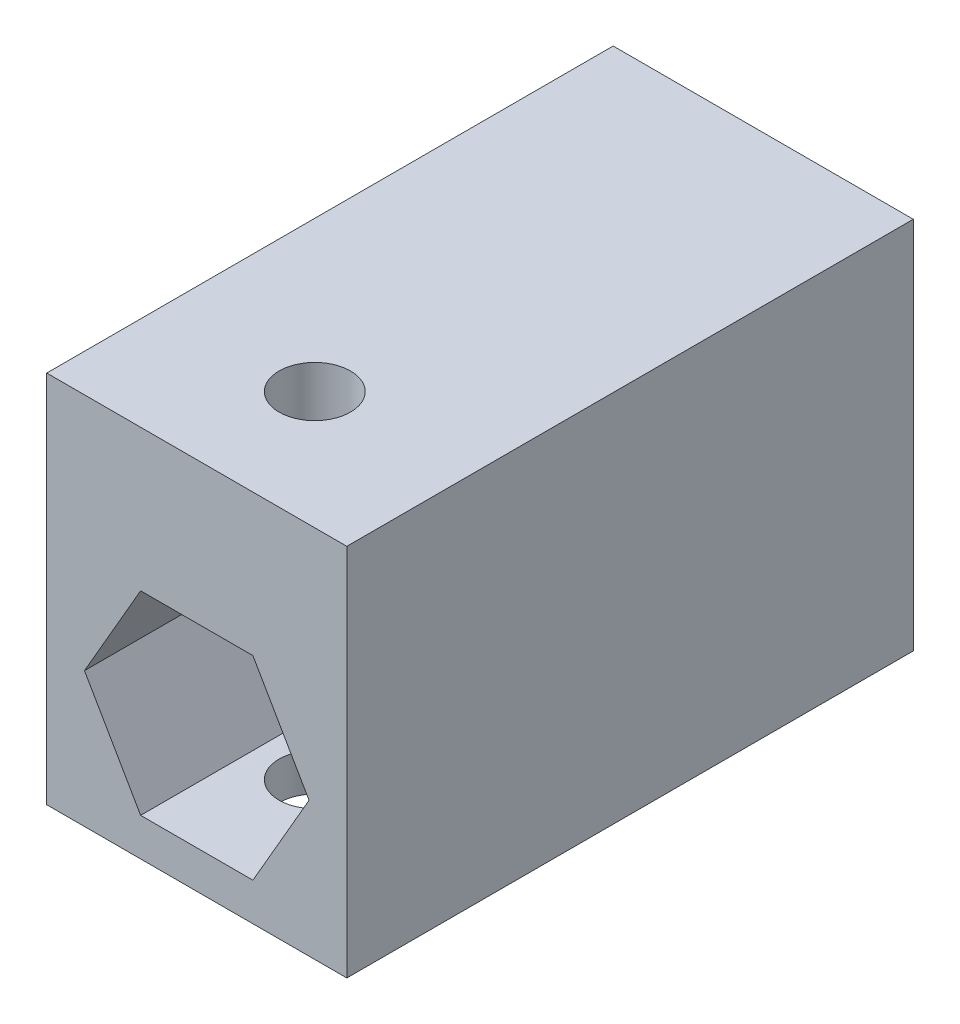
ISO-10303-21;
HEADER;
FILE_DESCRIPTION(('STEP AP214'),'2;1');
FILE_NAME('part.step','',(''),(''),'','','');
FILE_SCHEMA(('AUTOMOTIVE_DESIGN { 1 0 10303 214 1 1 1 1 }'));
ENDSEC;
DATA;
#1=APPLICATION_CONTEXT('core data for automotive mechanical design processes');
#2=APPLICATION_PROTOCOL_DEFINITION('international standard','automotive_design',2000,#1);
#3=PRODUCT_CONTEXT('',#1,'mechanical');
#4=PRODUCT('Part','Part','',(#3));
#5=PRODUCT_RELATED_PRODUCT_CATEGORY('part','',(#4));
#6=PRODUCT_DEFINITION_FORMATION('','',#4);
#7=PRODUCT_DEFINITION_CONTEXT('part definition',#1,'design');
#8=PRODUCT_DEFINITION('design','',#6,#7);
#9=PRODUCT_DEFINITION_SHAPE('','',#8);
#10=(LENGTH_UNIT() NAMED_UNIT(*) SI_UNIT(.MILLI.,.METRE.));
#11=(NAMED_UNIT(*) PLANE_ANGLE_UNIT() SI_UNIT($,.RADIAN.));
#12=(NAMED_UNIT(*) SI_UNIT($,.STERADIAN.) SOLID_ANGLE_UNIT());
#13=UNCERTAINTY_MEASURE_WITH_UNIT(LENGTH_MEASURE(1.E-05),#10,'distance_accuracy_value','');
#14=(GEOMETRIC_REPRESENTATION_CONTEXT(3) GLOBAL_UNCERTAINTY_ASSIGNED_CONTEXT((#13)) GLOBAL_UNIT_ASSIGNED_CONTEXT((#10,
#11,#12)) REPRESENTATION_CONTEXT('',''));
#15=CARTESIAN_POINT('',(0.,0.,0.));
#16=DIRECTION('',(0.,0.,1.));
#17=DIRECTION('',(1.,0.,0.));
#18=AXIS2_PLACEMENT_3D('',#15,#16,#17);
#19=CARTESIAN_POINT('',(0.,0.,28.575));
#20=DIRECTION('',(0.,0.,-1.));
#21=DIRECTION('',(-1.,0.,0.));
#22=AXIS2_PLACEMENT_3D('',#19,#20,#21);
#23=PLANE('',#22);
#24=DIRECTION('',(0.,-1.,0.));
#25=VECTOR('',#24,1.);
#26=CARTESIAN_POINT('',(0.,0.,28.575));
#27=LINE('',#26,#25);
#28=CARTESIAN_POINT('',(0.,25.146,28.575));
#29=VERTEX_POINT('',#28);
#30=CARTESIAN_POINT('',(0.,0.,28.575));
#31=VERTEX_POINT('',#30);
#32=EDGE_CURVE('E195',#29,#31,#27,.T.);
#33=ORIENTED_EDGE('',*,*,#32,.T.);
#34=DIRECTION('',(1.,0.,0.));
#35=VECTOR('',#34,1.);
#36=CARTESIAN_POINT('',(0.,0.,28.575));
#37=LINE('',#36,#35);
#38=CARTESIAN_POINT('',(20.184637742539,0.,28.575));
#39=VERTEX_POINT('',#38);
#40=EDGE_CURVE('E198',#31,#39,#37,.T.);
#41=ORIENTED_EDGE('',*,*,#40,.T.);
#42=DIRECTION('',(0.,1.,0.));
#43=VECTOR('',#42,1.);
#44=CARTESIAN_POINT('',(20.184637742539,0.,28.575));
#45=LINE('',#44,#43);
#46=CARTESIAN_POINT('',(20.184637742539,25.146,28.575));
#47=VERTEX_POINT('',#46);
#48=EDGE_CURVE('E120',#39,#47,#45,.T.);
#49=ORIENTED_EDGE('',*,*,#48,.T.);
#50=DIRECTION('',(-1.,0.,0.));
#51=VECTOR('',#50,1.);
#52=CARTESIAN_POINT('',(0.,25.146,28.575));
#53=LINE('',#52,#51);
#54=EDGE_CURVE('E201',#47,#29,#53,.T.);
#55=ORIENTED_EDGE('',*,*,#54,.T.);
#56=EDGE_LOOP('',(#33,#41,#49,#55));
#57=FACE_BOUND('',#56,.T.);
#58=DIRECTION('',(-0.5,0.866025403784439,0.));
#59=VECTOR('',#58,1.);
#60=CARTESIAN_POINT('',(17.644637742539,9.0805,28.575));
#61=LINE('',#60,#59);
#62=CARTESIAN_POINT('',(17.644637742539,9.0805,28.575));
#63=VERTEX_POINT('',#62);
#64=CARTESIAN_POINT('',(13.8684783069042,15.621,28.575));
#65=VERTEX_POINT('',#64);
#66=EDGE_CURVE('E156',#63,#65,#61,.T.);
#67=ORIENTED_EDGE('',*,*,#66,.F.);
#68=DIRECTION('',(0.5,0.866025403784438,0.));
#69=VECTOR('',#68,1.);
#70=CARTESIAN_POINT('',(13.8684783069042,2.54,28.575));
#71=LINE('',#70,#69);
#72=CARTESIAN_POINT('',(13.8684783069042,2.54,28.575));
#73=VERTEX_POINT('',#72);
#74=EDGE_CURVE('E167',#73,#63,#71,.T.);
#75=ORIENTED_EDGE('',*,*,#74,.F.);
#76=DIRECTION('',(1.,0.,0.));
#77=VECTOR('',#76,1.);
#78=CARTESIAN_POINT('',(6.31615943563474,2.54,28.575));
#79=LINE('',#78,#77);
#80=CARTESIAN_POINT('',(6.31615943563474,2.54,28.575));
#81=VERTEX_POINT('',#80);
#82=EDGE_CURVE('E165',#81,#73,#79,.T.);
#83=ORIENTED_EDGE('',*,*,#82,.F.);
#84=DIRECTION('',(0.5,-0.866025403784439,0.));
#85=VECTOR('',#84,1.);
#86=CARTESIAN_POINT('',(2.54,9.08049999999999,28.575));
#87=LINE('',#86,#85);
#88=CARTESIAN_POINT('',(2.54,9.08049999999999,28.575));
#89=VERTEX_POINT('',#88);
#90=EDGE_CURVE('E163',#89,#81,#87,.T.);
#91=ORIENTED_EDGE('',*,*,#90,.F.);
#92=DIRECTION('',(-0.5,-0.866025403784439,0.));
#93=VECTOR('',#92,1.);
#94=CARTESIAN_POINT('',(6.31615943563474,15.621,28.575));
#95=LINE('',#94,#93);
#96=CARTESIAN_POINT('',(6.31615943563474,15.621,28.575));
#97=VERTEX_POINT('',#96);
#98=EDGE_CURVE('E161',#97,#89,#95,.T.);
#99=ORIENTED_EDGE('',*,*,#98,.F.);
#100=DIRECTION('',(-1.,0.,0.));
#101=VECTOR('',#100,1.);
#102=CARTESIAN_POINT('',(13.8684783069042,15.621,28.575));
#103=LINE('',#102,#101);
#104=EDGE_CURVE('E158',#65,#97,#103,.T.);
#105=ORIENTED_EDGE('',*,*,#104,.F.);
#106=EDGE_LOOP('',(#67,#75,#83,#91,#99,#105));
#107=FACE_BOUND('',#106,.T.);
#108=ADVANCED_FACE('F35',(#57,#107),#23,.F.);
#109=CARTESIAN_POINT('',(0.,0.,28.575));
#110=DIRECTION('',(1.,0.,0.));
#111=DIRECTION('',(0.,0.,-1.));
#112=AXIS2_PLACEMENT_3D('',#109,#110,#111);
#113=PLANE('',#112);
#114=DIRECTION('',(0.,0.,-1.));
#115=VECTOR('',#114,1.);
#116=CARTESIAN_POINT('',(0.,25.146,28.575));
#117=LINE('',#116,#115);
#118=CARTESIAN_POINT('',(0.,25.146,-9.525));
#119=VERTEX_POINT('',#118);
#120=EDGE_CURVE('E203',#29,#119,#117,.T.);
#121=ORIENTED_EDGE('',*,*,#120,.T.);
#122=DIRECTION('',(0.,1.,0.));
#123=VECTOR('',#122,1.);
#124=CARTESIAN_POINT('',(0.,0.,-9.525));
#125=LINE('',#124,#123);
#126=CARTESIAN_POINT('',(0.,0.,-9.525));
#127=VERTEX_POINT('',#126);
#128=EDGE_CURVE('E131',#127,#119,#125,.T.);
#129=ORIENTED_EDGE('',*,*,#128,.F.);
#130=DIRECTION('',(0.,0.,-1.));
#131=VECTOR('',#130,1.);
#132=CARTESIAN_POINT('',(0.,0.,28.575));
#133=LINE('',#132,#131);
#134=EDGE_CURVE('E11',#31,#127,#133,.T.);
#135=ORIENTED_EDGE('',*,*,#134,.F.);
#136=ORIENTED_EDGE('',*,*,#32,.F.);
#137=EDGE_LOOP('',(#121,#129,#135,#136));
#138=FACE_BOUND('',#137,.T.);
#139=ADVANCED_FACE('F37',(#138),#113,.F.);
#140=CARTESIAN_POINT('',(0.,0.,28.575));
#141=DIRECTION('',(0.,1.,0.));
#142=DIRECTION('',(0.,0.,1.));
#143=AXIS2_PLACEMENT_3D('',#140,#141,#142);
#144=PLANE('',#143);
#145=CARTESIAN_POINT('',(10.0923188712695,0.,20.6375));
#146=DIRECTION('',(0.,1.,0.));
#147=DIRECTION('',(0.,0.,1.));
#148=AXIS2_PLACEMENT_3D('',#145,#146,#147);
#149=CIRCLE('',#148,2.40029999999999);
#150=CARTESIAN_POINT('',(10.0923188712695,0.,23.0378));
#151=VERTEX_POINT('',#150);
#152=EDGE_CURVE('E150',#151,#151,#149,.T.);
#153=ORIENTED_EDGE('',*,*,#152,.T.);
#154=EDGE_LOOP('',(#153));
#155=FACE_BOUND('',#154,.T.);
#156=ORIENTED_EDGE('',*,*,#134,.T.);
#157=DIRECTION('',(-1.,0.,0.));
#158=VECTOR('',#157,1.);
#159=CARTESIAN_POINT('',(20.184637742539,0.,-9.525));
#160=LINE('',#159,#158);
#161=CARTESIAN_POINT('',(20.184637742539,0.,-9.525));
#162=VERTEX_POINT('',#161);
#163=EDGE_CURVE('E125',#162,#127,#160,.T.);
#164=ORIENTED_EDGE('',*,*,#163,.F.);
#165=DIRECTION('',(0.,0.,-1.));
#166=VECTOR('',#165,1.);
#167=CARTESIAN_POINT('',(20.184637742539,0.,28.575));
#168=LINE('',#167,#166);
#169=EDGE_CURVE('E44',#39,#162,#168,.T.);
#170=ORIENTED_EDGE('',*,*,#169,.F.);
#171=ORIENTED_EDGE('',*,*,#40,.F.);
#172=EDGE_LOOP('',(#156,#164,#170,#171));
#173=FACE_BOUND('',#172,.T.);
#174=ADVANCED_FACE('F126',(#155,#173),#144,.F.);
#175=CARTESIAN_POINT('',(20.184637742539,0.,28.575));
#176=DIRECTION('',(-1.,0.,0.));
#177=DIRECTION('',(0.,-1.,0.));
#178=AXIS2_PLACEMENT_3D('',#175,#176,#177);
#179=PLANE('',#178);
#180=ORIENTED_EDGE('',*,*,#169,.T.);
#181=DIRECTION('',(0.,-1.,0.));
#182=VECTOR('',#181,1.);
#183=CARTESIAN_POINT('',(20.184637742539,0.,-9.525));
#184=LINE('',#183,#182);
#185=CARTESIAN_POINT('',(20.184637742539,25.146,-9.525));
#186=VERTEX_POINT('',#185);
#187=EDGE_CURVE('E119',#186,#162,#184,.T.);
#188=ORIENTED_EDGE('',*,*,#187,.F.);
#189=DIRECTION('',(0.,0.,-1.));
#190=VECTOR('',#189,1.);
#191=CARTESIAN_POINT('',(20.184637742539,25.146,28.575));
#192=LINE('',#191,#190);
#193=EDGE_CURVE('E122',#47,#186,#192,.T.);
#194=ORIENTED_EDGE('',*,*,#193,.F.);
#195=ORIENTED_EDGE('',*,*,#48,.F.);
#196=EDGE_LOOP('',(#180,#188,#194,#195));
#197=FACE_BOUND('',#196,.T.);
#198=ADVANCED_FACE('F116',(#197),#179,.F.);
#199=CARTESIAN_POINT('',(0.,25.146,28.575));
#200=DIRECTION('',(0.,-1.,0.));
#201=DIRECTION('',(0.,0.,-1.));
#202=AXIS2_PLACEMENT_3D('',#199,#200,#201);
#203=PLANE('',#202);
#204=CARTESIAN_POINT('',(10.0923188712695,25.146,20.6375));
#205=DIRECTION('',(0.,1.,0.));
#206=DIRECTION('',(0.,0.,1.));
#207=AXIS2_PLACEMENT_3D('',#204,#205,#206);
#208=CIRCLE('',#207,2.40029999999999);
#209=CARTESIAN_POINT('',(10.0923188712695,25.146,23.0378));
#210=VERTEX_POINT('',#209);
#211=EDGE_CURVE('E147',#210,#210,#208,.T.);
#212=ORIENTED_EDGE('',*,*,#211,.F.);
#213=EDGE_LOOP('',(#212));
#214=FACE_BOUND('',#213,.T.);
#215=ORIENTED_EDGE('',*,*,#193,.T.);
#216=DIRECTION('',(1.,0.,0.));
#217=VECTOR('',#216,1.);
#218=CARTESIAN_POINT('',(20.184637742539,25.146,-9.525));
#219=LINE('',#218,#217);
#220=EDGE_CURVE('E137',#119,#186,#219,.T.);
#221=ORIENTED_EDGE('',*,*,#220,.F.);
#222=ORIENTED_EDGE('',*,*,#120,.F.);
#223=ORIENTED_EDGE('',*,*,#54,.F.);
#224=EDGE_LOOP('',(#215,#221,#222,#223));
#225=FACE_BOUND('',#224,.T.);
#226=ADVANCED_FACE('F207',(#214,#225),#203,.F.);
#227=CARTESIAN_POINT('',(17.644637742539,9.0805,28.575));
#228=DIRECTION('',(-0.866025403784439,-0.5,0.));
#229=DIRECTION('',(0.5,-0.866025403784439,0.));
#230=AXIS2_PLACEMENT_3D('',#227,#228,#229);
#231=PLANE('',#230);
#232=DIRECTION('',(-0.5,0.866025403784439,0.));
#233=VECTOR('',#232,1.);
#234=CARTESIAN_POINT('',(17.644637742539,9.0805,0.));
#235=LINE('',#234,#233);
#236=CARTESIAN_POINT('',(17.644637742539,9.0805,0.));
#237=VERTEX_POINT('',#236);
#238=CARTESIAN_POINT('',(13.8684783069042,15.621,0.));
#239=VERTEX_POINT('',#238);
#240=EDGE_CURVE('E59',#237,#239,#235,.T.);
#241=ORIENTED_EDGE('',*,*,#240,.F.);
#242=DIRECTION('',(0.,0.,-1.));
#243=VECTOR('',#242,1.);
#244=CARTESIAN_POINT('',(17.644637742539,9.0805,28.575));
#245=LINE('',#244,#243);
#246=EDGE_CURVE('E169',#63,#237,#245,.T.);
#247=ORIENTED_EDGE('',*,*,#246,.F.);
#248=ORIENTED_EDGE('',*,*,#66,.T.);
#249=DIRECTION('',(0.,0.,-1.));
#250=VECTOR('',#249,1.);
#251=CARTESIAN_POINT('',(13.8684783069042,15.621,28.575));
#252=LINE('',#251,#250);
#253=EDGE_CURVE('E193',#65,#239,#252,.T.);
#254=ORIENTED_EDGE('',*,*,#253,.T.);
#255=EDGE_LOOP('',(#241,#247,#248,#254));
#256=FACE_BOUND('',#255,.T.);
#257=ADVANCED_FACE('F224',(#256),#231,.T.);
#258=CARTESIAN_POINT('',(13.8684783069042,15.621,28.575));
#259=DIRECTION('',(0.,-1.,0.));
#260=DIRECTION('',(0.,0.,-1.));
#261=AXIS2_PLACEMENT_3D('',#258,#259,#260);
#262=PLANE('',#261);
#263=CARTESIAN_POINT('',(10.0923188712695,15.621,20.6375));
#264=DIRECTION('',(0.,-1.,0.));
#265=DIRECTION('',(0.,0.,-1.));
#266=AXIS2_PLACEMENT_3D('',#263,#264,#265);
#267=CIRCLE('',#266,2.40029999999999);
#268=CARTESIAN_POINT('',(10.0923188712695,15.621,18.2372));
#269=VERTEX_POINT('',#268);
#270=EDGE_CURVE('E39',#269,#269,#267,.T.);
#271=ORIENTED_EDGE('',*,*,#270,.F.);
#272=EDGE_LOOP('',(#271));
#273=FACE_BOUND('',#272,.T.);
#274=DIRECTION('',(-1.,0.,0.));
#275=VECTOR('',#274,1.);
#276=CARTESIAN_POINT('',(13.8684783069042,15.621,0.));
#277=LINE('',#276,#275);
#278=CARTESIAN_POINT('',(6.31615943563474,15.621,0.));
#279=VERTEX_POINT('',#278);
#280=EDGE_CURVE('E171',#239,#279,#277,.T.);
#281=ORIENTED_EDGE('',*,*,#280,.F.);
#282=ORIENTED_EDGE('',*,*,#253,.F.);
#283=ORIENTED_EDGE('',*,*,#104,.T.);
#284=DIRECTION('',(0.,0.,-1.));
#285=VECTOR('',#284,1.);
#286=CARTESIAN_POINT('',(6.31615943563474,15.621,28.575));
#287=LINE('',#286,#285);
#288=EDGE_CURVE('E191',#97,#279,#287,.T.);
#289=ORIENTED_EDGE('',*,*,#288,.T.);
#290=EDGE_LOOP('',(#281,#282,#283,#289));
#291=FACE_BOUND('',#290,.T.);
#292=ADVANCED_FACE('F244',(#273,#291),#262,.T.);
#293=CARTESIAN_POINT('',(6.31615943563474,15.621,28.575));
#294=DIRECTION('',(0.866025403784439,-0.5,0.));
#295=DIRECTION('',(0.5,0.866025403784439,0.));
#296=AXIS2_PLACEMENT_3D('',#293,#294,#295);
#297=PLANE('',#296);
#298=DIRECTION('',(-0.5,-0.866025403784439,0.));
#299=VECTOR('',#298,1.);
#300=CARTESIAN_POINT('',(6.31615943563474,15.621,0.));
#301=LINE('',#300,#299);
#302=CARTESIAN_POINT('',(2.54,9.08049999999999,0.));
#303=VERTEX_POINT('',#302);
#304=EDGE_CURVE('E174',#279,#303,#301,.T.);
#305=ORIENTED_EDGE('',*,*,#304,.F.);
#306=ORIENTED_EDGE('',*,*,#288,.F.);
#307=ORIENTED_EDGE('',*,*,#98,.T.);
#308=DIRECTION('',(0.,0.,-1.));
#309=VECTOR('',#308,1.);
#310=CARTESIAN_POINT('',(2.54,9.08049999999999,28.575));
#311=LINE('',#310,#309);
#312=EDGE_CURVE('E189',#89,#303,#311,.T.);
#313=ORIENTED_EDGE('',*,*,#312,.T.);
#314=EDGE_LOOP('',(#305,#306,#307,#313));
#315=FACE_BOUND('',#314,.T.);
#316=ADVANCED_FACE('F250',(#315),#297,.T.);
#317=CARTESIAN_POINT('',(2.54,9.08049999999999,28.575));
#318=DIRECTION('',(0.866025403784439,0.5,0.));
#319=DIRECTION('',(-0.5,0.866025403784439,0.));
#320=AXIS2_PLACEMENT_3D('',#317,#318,#319);
#321=PLANE('',#320);
#322=DIRECTION('',(0.5,-0.866025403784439,0.));
#323=VECTOR('',#322,1.);
#324=CARTESIAN_POINT('',(2.54,9.08049999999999,0.));
#325=LINE('',#324,#323);
#326=CARTESIAN_POINT('',(6.31615943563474,2.54,0.));
#327=VERTEX_POINT('',#326);
#328=EDGE_CURVE('E177',#303,#327,#325,.T.);
#329=ORIENTED_EDGE('',*,*,#328,.F.);
#330=ORIENTED_EDGE('',*,*,#312,.F.);
#331=ORIENTED_EDGE('',*,*,#90,.T.);
#332=DIRECTION('',(0.,0.,-1.));
#333=VECTOR('',#332,1.);
#334=CARTESIAN_POINT('',(6.31615943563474,2.54,28.575));
#335=LINE('',#334,#333);
#336=EDGE_CURVE('E187',#81,#327,#335,.T.);
#337=ORIENTED_EDGE('',*,*,#336,.T.);
#338=EDGE_LOOP('',(#329,#330,#331,#337));
#339=FACE_BOUND('',#338,.T.);
#340=ADVANCED_FACE('F257',(#339),#321,.T.);
#341=CARTESIAN_POINT('',(6.31615943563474,2.54,28.575));
#342=DIRECTION('',(0.,1.,0.));
#343=DIRECTION('',(-1.,0.,0.));
#344=AXIS2_PLACEMENT_3D('',#341,#342,#343);
#345=PLANE('',#344);
#346=CARTESIAN_POINT('',(10.0923188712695,2.54,20.6375));
#347=DIRECTION('',(0.,1.,0.));
#348=DIRECTION('',(-1.,0.,0.));
#349=AXIS2_PLACEMENT_3D('',#346,#347,#348);
#350=CIRCLE('',#349,2.40029999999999);
#351=CARTESIAN_POINT('',(7.69201887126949,2.54,20.6375));
#352=VERTEX_POINT('',#351);
#353=EDGE_CURVE('E153',#352,#352,#350,.T.);
#354=ORIENTED_EDGE('',*,*,#353,.F.);
#355=EDGE_LOOP('',(#354));
#356=FACE_BOUND('',#355,.T.);
#357=DIRECTION('',(1.,0.,0.));
#358=VECTOR('',#357,1.);
#359=CARTESIAN_POINT('',(6.31615943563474,2.54,0.));
#360=LINE('',#359,#358);
#361=CARTESIAN_POINT('',(13.8684783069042,2.54,0.));
#362=VERTEX_POINT('',#361);
#363=EDGE_CURVE('E180',#327,#362,#360,.T.);
#364=ORIENTED_EDGE('',*,*,#363,.F.);
#365=ORIENTED_EDGE('',*,*,#336,.F.);
#366=ORIENTED_EDGE('',*,*,#82,.T.);
#367=DIRECTION('',(0.,0.,-1.));
#368=VECTOR('',#367,1.);
#369=CARTESIAN_POINT('',(13.8684783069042,2.54,28.575));
#370=LINE('',#369,#368);
#371=EDGE_CURVE('E51',#73,#362,#370,.T.);
#372=ORIENTED_EDGE('',*,*,#371,.T.);
#373=EDGE_LOOP('',(#364,#365,#366,#372));
#374=FACE_BOUND('',#373,.T.);
#375=ADVANCED_FACE('F265',(#356,#374),#345,.T.);
#376=CARTESIAN_POINT('',(13.8684783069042,2.54,28.575));
#377=DIRECTION('',(-0.866025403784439,0.5,0.));
#378=DIRECTION('',(-0.5,-0.866025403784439,0.));
#379=AXIS2_PLACEMENT_3D('',#376,#377,#378);
#380=PLANE('',#379);
#381=DIRECTION('',(0.5,0.866025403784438,0.));
#382=VECTOR('',#381,1.);
#383=CARTESIAN_POINT('',(13.8684783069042,2.54,0.));
#384=LINE('',#383,#382);
#385=EDGE_CURVE('E159',#362,#237,#384,.T.);
#386=ORIENTED_EDGE('',*,*,#385,.F.);
#387=ORIENTED_EDGE('',*,*,#371,.F.);
#388=ORIENTED_EDGE('',*,*,#74,.T.);
#389=ORIENTED_EDGE('',*,*,#246,.T.);
#390=EDGE_LOOP('',(#386,#387,#388,#389));
#391=FACE_BOUND('',#390,.T.);
#392=ADVANCED_FACE('F273',(#391),#380,.T.);
#393=CARTESIAN_POINT('',(10.0923188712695,25.146,20.6375));
#394=DIRECTION('',(0.,1.,0.));
#395=DIRECTION('',(0.,0.,1.));
#396=AXIS2_PLACEMENT_3D('',#393,#394,#395);
#397=CYLINDRICAL_SURFACE('',#396,2.40029999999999);
#398=ORIENTED_EDGE('',*,*,#270,.T.);
#399=EDGE_LOOP('',(#398));
#400=FACE_BOUND('',#399,.T.);
#401=ORIENTED_EDGE('',*,*,#211,.T.);
#402=EDGE_LOOP('',(#401));
#403=FACE_BOUND('',#402,.T.);
#404=ADVANCED_FACE('F281',(#400,#403),#397,.F.);
#405=ORIENTED_EDGE('',*,*,#353,.T.);
#406=EDGE_LOOP('',(#405));
#407=FACE_BOUND('',#406,.T.);
#408=ORIENTED_EDGE('',*,*,#152,.F.);
#409=EDGE_LOOP('',(#408));
#410=FACE_BOUND('',#409,.T.);
#411=ADVANCED_FACE('F289',(#407,#410),#397,.F.);
#412=CARTESIAN_POINT('',(0.,0.,-9.525));
#413=DIRECTION('',(0.,0.,1.));
#414=DIRECTION('',(1.,0.,0.));
#415=AXIS2_PLACEMENT_3D('',#412,#413,#414);
#416=PLANE('',#415);
#417=ORIENTED_EDGE('',*,*,#187,.T.);
#418=ORIENTED_EDGE('',*,*,#163,.T.);
#419=ORIENTED_EDGE('',*,*,#128,.T.);
#420=ORIENTED_EDGE('',*,*,#220,.T.);
#421=EDGE_LOOP('',(#417,#418,#419,#420));
#422=FACE_BOUND('',#421,.T.);
#423=CARTESIAN_POINT('',(10.0923188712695,9.0805,-9.525));
#424=DIRECTION('',(0.,0.,-1.));
#425=DIRECTION('',(-1.,0.,0.));
#426=AXIS2_PLACEMENT_3D('',#423,#424,#425);
#427=CIRCLE('',#426,2.413);
#428=CARTESIAN_POINT('',(12.5053188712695,9.0805,-9.525));
#429=VERTEX_POINT('',#428);
#430=EDGE_CURVE('E138',#429,#429,#427,.T.);
#431=ORIENTED_EDGE('',*,*,#430,.F.);
#432=EDGE_LOOP('',(#431));
#433=FACE_BOUND('',#432,.T.);
#434=ADVANCED_FACE('F134',(#422,#433),#416,.F.);
#435=CARTESIAN_POINT('',(0.,0.,0.));
#436=DIRECTION('',(0.,0.,1.));
#437=DIRECTION('',(1.,0.,0.));
#438=AXIS2_PLACEMENT_3D('',#435,#436,#437);
#439=PLANE('',#438);
#440=ORIENTED_EDGE('',*,*,#363,.T.);
#441=ORIENTED_EDGE('',*,*,#385,.T.);
#442=ORIENTED_EDGE('',*,*,#240,.T.);
#443=ORIENTED_EDGE('',*,*,#280,.T.);
#444=ORIENTED_EDGE('',*,*,#304,.T.);
#445=ORIENTED_EDGE('',*,*,#328,.T.);
#446=EDGE_LOOP('',(#440,#441,#442,#443,#444,#445));
#447=FACE_BOUND('',#446,.T.);
#448=CARTESIAN_POINT('',(10.0923188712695,9.0805,0.));
#449=DIRECTION('',(0.,0.,-1.));
#450=DIRECTION('',(-1.,0.,0.));
#451=AXIS2_PLACEMENT_3D('',#448,#449,#450);
#452=CIRCLE('',#451,2.413);
#453=CARTESIAN_POINT('',(12.5053188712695,9.0805,0.));
#454=VERTEX_POINT('',#453);
#455=EDGE_CURVE('E141',#454,#454,#452,.T.);
#456=ORIENTED_EDGE('',*,*,#455,.T.);
#457=EDGE_LOOP('',(#456));
#458=FACE_BOUND('',#457,.T.);
#459=ADVANCED_FACE('F302',(#447,#458),#439,.T.);
#460=CARTESIAN_POINT('',(10.0923188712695,9.0805,-9.525));
#461=DIRECTION('',(0.,0.,1.));
#462=DIRECTION('',(1.,0.,0.));
#463=AXIS2_PLACEMENT_3D('',#460,#461,#462);
#464=CYLINDRICAL_SURFACE('',#463,2.413);
#465=CARTESIAN_POINT('',(12.5053188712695,9.0805,-9.525));
#466=CARTESIAN_POINT('',(12.5053188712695,9.0805,-9.42578125));
#467=CARTESIAN_POINT('',(12.5053188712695,9.0805,-9.3265625));
#468=CARTESIAN_POINT('',(12.5053188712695,9.0805,-9.128125));
#469=CARTESIAN_POINT('',(12.5053188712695,9.0805,-9.02890625));
#470=CARTESIAN_POINT('',(12.5053188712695,9.0805,-8.83046875));
#471=CARTESIAN_POINT('',(12.5053188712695,9.0805,-8.73125));
#472=CARTESIAN_POINT('',(12.5053188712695,9.0805,-8.5328125));
#473=CARTESIAN_POINT('',(12.5053188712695,9.0805,-8.43359375));
#474=CARTESIAN_POINT('',(12.5053188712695,9.0805,-8.23515625));
#475=CARTESIAN_POINT('',(12.5053188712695,9.0805,-8.1359375));
#476=CARTESIAN_POINT('',(12.5053188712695,9.0805,-7.9375));
#477=CARTESIAN_POINT('',(12.5053188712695,9.0805,-7.83828125));
#478=CARTESIAN_POINT('',(12.5053188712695,9.0805,-7.63984375));
#479=CARTESIAN_POINT('',(12.5053188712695,9.0805,-7.540625));
#480=CARTESIAN_POINT('',(12.5053188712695,9.0805,-7.3421875));
#481=CARTESIAN_POINT('',(12.5053188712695,9.0805,-7.24296875));
#482=CARTESIAN_POINT('',(12.5053188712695,9.0805,-7.04453125));
#483=CARTESIAN_POINT('',(12.5053188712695,9.0805,-6.9453125));
#484=CARTESIAN_POINT('',(12.5053188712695,9.0805,-6.746875));
#485=CARTESIAN_POINT('',(12.5053188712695,9.0805,-6.64765625));
#486=CARTESIAN_POINT('',(12.5053188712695,9.0805,-6.44921875));
#487=CARTESIAN_POINT('',(12.5053188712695,9.0805,-6.35));
#488=CARTESIAN_POINT('',(12.5053188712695,9.0805,-6.1515625));
#489=CARTESIAN_POINT('',(12.5053188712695,9.0805,-6.05234375));
#490=CARTESIAN_POINT('',(12.5053188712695,9.0805,-5.85390625));
#491=CARTESIAN_POINT('',(12.5053188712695,9.0805,-5.7546875));
#492=CARTESIAN_POINT('',(12.5053188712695,9.0805,-5.55625));
#493=CARTESIAN_POINT('',(12.5053188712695,9.0805,-5.45703125));
#494=CARTESIAN_POINT('',(12.5053188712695,9.0805,-5.25859375));
#495=CARTESIAN_POINT('',(12.5053188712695,9.0805,-5.159375));
#496=CARTESIAN_POINT('',(12.5053188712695,9.0805,-4.9609375));
#497=CARTESIAN_POINT('',(12.5053188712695,9.0805,-4.86171875));
#498=CARTESIAN_POINT('',(12.5053188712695,9.0805,-4.66328125));
#499=CARTESIAN_POINT('',(12.5053188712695,9.0805,-4.5640625));
#500=CARTESIAN_POINT('',(12.5053188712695,9.0805,-4.365625));
#501=CARTESIAN_POINT('',(12.5053188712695,9.0805,-4.26640625));
#502=CARTESIAN_POINT('',(12.5053188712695,9.0805,-4.06796875));
#503=CARTESIAN_POINT('',(12.5053188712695,9.0805,-3.96875));
#504=CARTESIAN_POINT('',(12.5053188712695,9.0805,-3.7703125));
#505=CARTESIAN_POINT('',(12.5053188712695,9.0805,-3.67109375));
#506=CARTESIAN_POINT('',(12.5053188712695,9.0805,-3.47265625));
#507=CARTESIAN_POINT('',(12.5053188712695,9.0805,-3.3734375));
#508=CARTESIAN_POINT('',(12.5053188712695,9.0805,-3.175));
#509=CARTESIAN_POINT('',(12.5053188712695,9.0805,-3.07578125));
#510=CARTESIAN_POINT('',(12.5053188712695,9.0805,-2.87734375));
#511=CARTESIAN_POINT('',(12.5053188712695,9.0805,-2.778125));
#512=CARTESIAN_POINT('',(12.5053188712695,9.0805,-2.5796875));
#513=CARTESIAN_POINT('',(12.5053188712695,9.0805,-2.48046875));
#514=CARTESIAN_POINT('',(12.5053188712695,9.0805,-2.28203125));
#515=CARTESIAN_POINT('',(12.5053188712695,9.0805,-2.1828125));
#516=CARTESIAN_POINT('',(12.5053188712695,9.0805,-1.984375));
#517=CARTESIAN_POINT('',(12.5053188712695,9.0805,-1.88515625));
#518=CARTESIAN_POINT('',(12.5053188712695,9.0805,-1.68671875));
#519=CARTESIAN_POINT('',(12.5053188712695,9.0805,-1.5875));
#520=CARTESIAN_POINT('',(12.5053188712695,9.0805,-1.3890625));
#521=CARTESIAN_POINT('',(12.5053188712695,9.0805,-1.28984375));
#522=CARTESIAN_POINT('',(12.5053188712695,9.0805,-1.09140625));
#523=CARTESIAN_POINT('',(12.5053188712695,9.0805,-0.992187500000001));
#524=CARTESIAN_POINT('',(12.5053188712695,9.0805,-0.793750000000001));
#525=CARTESIAN_POINT('',(12.5053188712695,9.0805,-0.69453125));
#526=CARTESIAN_POINT('',(12.5053188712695,9.0805,-0.49609375));
#527=CARTESIAN_POINT('',(12.5053188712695,9.0805,-0.396875));
#528=CARTESIAN_POINT('',(12.5053188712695,9.0805,-0.1984375));
#529=CARTESIAN_POINT('',(12.5053188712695,9.0805,-0.0992187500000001));
#530=CARTESIAN_POINT('',(12.5053188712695,9.0805,0.));
#531=B_SPLINE_CURVE_WITH_KNOTS('',3,(#465,#466,#467,#468,#469,#470,#471,#472,#473,#474,#475,
#476,#477,#478,#479,#480,#481,#482,#483,#484,#485,#486,#487,#488,#489,#490,#491,#492,#493,#494,
#495,#496,#497,#498,#499,#500,#501,#502,#503,#504,#505,#506,#507,#508,#509,#510,#511,#512,#513,
#514,#515,#516,#517,#518,#519,#520,#521,#522,#523,#524,#525,#526,#527,#528,#529,#530),
.UNSPECIFIED.,.F.,.F.,(4,2,2,2,2,2,2,2,2,2,2,2,2,2,2,2,2,2,2,2,2,2,2,2,2,2,2,2,2,2,2,2,4),(0.,
0.29765625,0.5953125,0.892968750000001,1.190625,1.48828125,1.7859375,2.08359375,2.38125,
2.67890625,2.9765625,3.27421875,3.571875,3.86953125,4.1671875,4.46484375,4.7625,5.06015625,
5.3578125,5.65546875,5.953125,6.25078125,6.5484375,6.84609375,7.14375,7.44140625,7.7390625,
8.03671875,8.334375,8.63203125,8.9296875,9.22734375,9.525),.UNSPECIFIED.);
#532=EDGE_CURVE('BSEAM309',#429,#454,#531,.T.);
#533=ORIENTED_EDGE('',*,*,#430,.T.);
#534=ORIENTED_EDGE('',*,*,#455,.F.);
#535=ORIENTED_EDGE('',*,*,#532,.T.);
#536=ORIENTED_EDGE('',*,*,#532,.F.);
#537=EDGE_LOOP('',(#533,#535,#534,#536));
#538=FACE_BOUND('',#537,.T.);
#539=ADVANCED_FACE('F309',(#538),#464,.F.);
#540=CLOSED_SHELL('',(#108,#139,#174,#198,#226,#257,#292,#316,#340,#375,#392,#404,#411,#434,
#459,#539));
#541=MANIFOLD_SOLID_BREP('B2',#540);
#542=ADVANCED_BREP_SHAPE_REPRESENTATION('',(#18,#541),#14);
#543=SHAPE_DEFINITION_REPRESENTATION(#9,#542);
ENDSEC;
END-ISO-10303-21;
